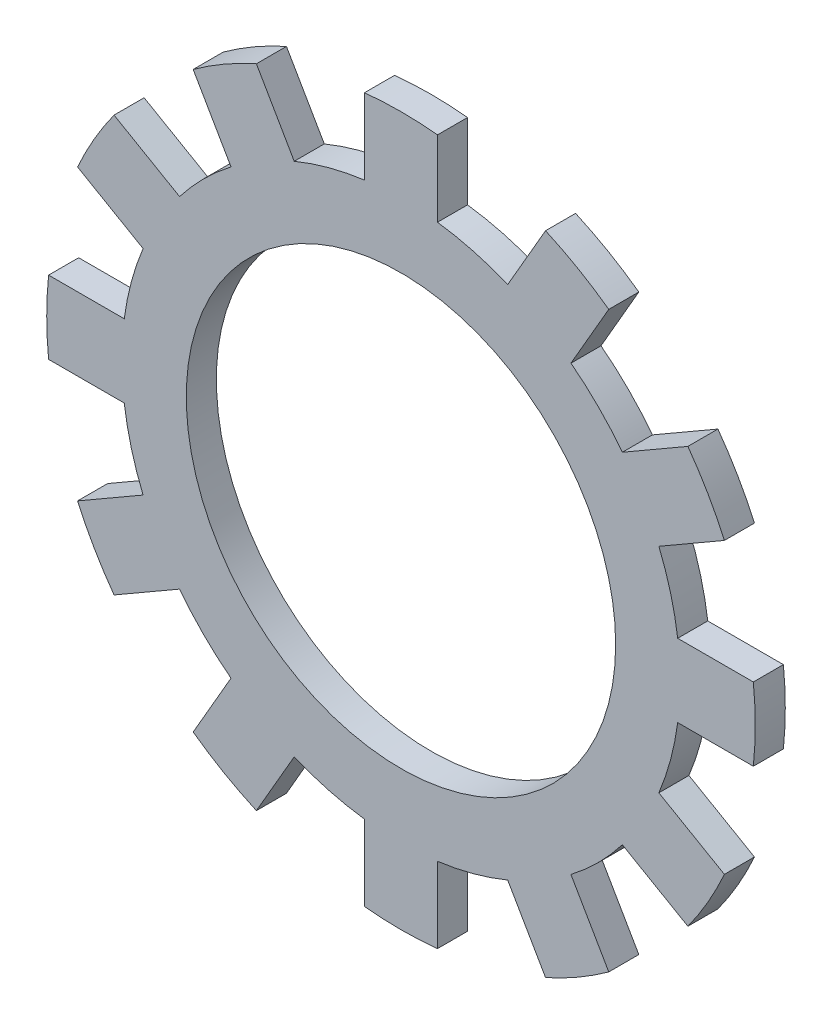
from build123d import *

# Parameters (mm, degrees)
SKETCH1_R                 = 13
SKETCH1_R_2               = 10
BOSS_EXTRUDE1_DEPTH       = 0.7
BOSS_EXTRUDE2_DEPTH       = 0.7
CIRPATTERN2_COUNT         = 12
CIRPATTERN2_COPY_1_DEPTH  = 0.7
CIRPATTERN2_COPY_2_DEPTH  = 0.7
CIRPATTERN2_COPY_3_DEPTH  = 0.7
CIRPATTERN2_COPY_4_DEPTH  = 0.7
CIRPATTERN2_COPY_5_DEPTH  = 0.7
CIRPATTERN2_COPY_6_DEPTH  = 0.7
CIRPATTERN2_COPY_7_DEPTH  = 0.7
CIRPATTERN2_COPY_8_DEPTH  = 0.7
CIRPATTERN2_COPY_9_DEPTH  = 0.7
CIRPATTERN2_COPY_10_DEPTH = 0.7
CIRPATTERN2_COPY_11_DEPTH = 0.7


with BuildPart() as part:
    # Sketch1 → Boss-Extrude1 (new, symmetric)
    with BuildSketch(Plane.XY):
        Circle(SKETCH1_R)
        Circle(SKETCH1_R_2, mode=Mode.SUBTRACT)
    extrude(amount=BOSS_EXTRUDE1_DEPTH, both=True)

    # Sketch3 → Boss-Extrude2 (add, symmetric)
    with BuildSketch(Plane.XY):
        with BuildLine():
            Line((-1.7, 16.412190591), (-1.7, 12.888366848))
            ThreePointArc((-1.7, 12.888366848), (-0.85183067, 12.972061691), (0, 13))
            Line((0, 13), (0, 16.5))
            ThreePointArc((0, 16.5), (-0.851133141, 16.478033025), (-1.7, 16.412190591))
        make_face()
    boss_extrude2 = extrude(amount=BOSS_EXTRUDE2_DEPTH, both=True)

    # Mirror1: Boss-Extrude2 across plane
    add(boss_extrude2.mirror(Plane(origin=(0, 0, 0), x_dir=(0, 0, 1), z_dir=(1, 0, 0))))

    # CirPattern2: Boss-Extrude2 ×12 about axis
    cirpattern2_axis = Axis((0, 0, 0), (0, 0, 1))
    for i in range(1, CIRPATTERN2_COUNT):
        add(boss_extrude2.rotate(cirpattern2_axis, i * 360 / CIRPATTERN2_COUNT))

    # CirPattern2 copy 1 sketch → CirPattern2 copy 1 (add, symmetric)
    with BuildSketch(Plane(origin=(0, 0, 0), x_dir=(-0.8660254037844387, -0.49999999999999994, 0), z_dir=(0, 0, 1))):
        with BuildLine():
            Line((-1.7, -16.412190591), (-1.7, -12.888366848))
            ThreePointArc((-1.7, -12.888366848), (-0.85183067, -12.972061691), (0, -13))
            Line((0, -13), (0, -16.5))
            ThreePointArc((0, -16.5), (-0.851133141, -16.478033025), (-1.7, -16.412190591))
        make_face()
    extrude(amount=CIRPATTERN2_COPY_1_DEPTH, both=True)

    # CirPattern2 copy 2 sketch → CirPattern2 copy 2 (add, symmetric)
    with BuildSketch(Plane(origin=(0, 0, 0), x_dir=(-0.5000000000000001, -0.8660254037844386, 0), z_dir=(0, 0, 1))):
        with BuildLine():
            Line((-1.7, -16.412190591), (-1.7, -12.888366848))
            ThreePointArc((-1.7, -12.888366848), (-0.85183067, -12.972061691), (0, -13))
            Line((0, -13), (0, -16.5))
            ThreePointArc((0, -16.5), (-0.851133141, -16.478033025), (-1.7, -16.412190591))
        make_face()
    extrude(amount=CIRPATTERN2_COPY_2_DEPTH, both=True)

    # CirPattern2 copy 3 sketch → CirPattern2 copy 3 (add, symmetric)
    with BuildSketch(Plane(origin=(0, 0, 0), x_dir=(0, -1, 0), z_dir=(0, 0, 1))):
        with BuildLine():
            Line((-1.7, -16.412190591), (-1.7, -12.888366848))
            ThreePointArc((-1.7, -12.888366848), (-0.85183067, -12.972061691), (0, -13))
            Line((0, -13), (0, -16.5))
            ThreePointArc((0, -16.5), (-0.851133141, -16.478033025), (-1.7, -16.412190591))
        make_face()
    extrude(amount=CIRPATTERN2_COPY_3_DEPTH, both=True)

    # CirPattern2 copy 4 sketch → CirPattern2 copy 4 (add, symmetric)
    with BuildSketch(Plane(origin=(0, 0, 0), x_dir=(0.4999999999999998, -0.8660254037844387, 0), z_dir=(0, 0, 1))):
        with BuildLine():
            Line((-1.7, -16.412190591), (-1.7, -12.888366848))
            ThreePointArc((-1.7, -12.888366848), (-0.85183067, -12.972061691), (0, -13))
            Line((0, -13), (0, -16.5))
            ThreePointArc((0, -16.5), (-0.851133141, -16.478033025), (-1.7, -16.412190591))
        make_face()
    extrude(amount=CIRPATTERN2_COPY_4_DEPTH, both=True)

    # CirPattern2 copy 5 sketch → CirPattern2 copy 5 (add, symmetric)
    with BuildSketch(Plane(origin=(0, 0, 0), x_dir=(0.8660254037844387, -0.49999999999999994, 0), z_dir=(0, 0, 1))):
        with BuildLine():
            Line((-1.7, -16.412190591), (-1.7, -12.888366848))
            ThreePointArc((-1.7, -12.888366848), (-0.85183067, -12.972061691), (0, -13))
            Line((0, -13), (0, -16.5))
            ThreePointArc((0, -16.5), (-0.851133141, -16.478033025), (-1.7, -16.412190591))
        make_face()
    extrude(amount=CIRPATTERN2_COPY_5_DEPTH, both=True)

    # CirPattern2 copy 6 sketch → CirPattern2 copy 6 (add, symmetric)
    with BuildSketch(Plane.XY):
        with BuildLine():
            Line((-1.7, -16.412190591), (-1.7, -12.888366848))
            ThreePointArc((-1.7, -12.888366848), (-0.85183067, -12.972061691), (0, -13))
            Line((0, -13), (0, -16.5))
            ThreePointArc((0, -16.5), (-0.851133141, -16.478033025), (-1.7, -16.412190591))
        make_face()
    extrude(amount=CIRPATTERN2_COPY_6_DEPTH, both=True)

    # CirPattern2 copy 7 sketch → CirPattern2 copy 7 (add, symmetric)
    with BuildSketch(Plane(origin=(0, 0, 0), x_dir=(0.8660254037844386, 0.5000000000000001, 0), z_dir=(0, 0, 1))):
        with BuildLine():
            Line((-1.7, -16.412190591), (-1.7, -12.888366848))
            ThreePointArc((-1.7, -12.888366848), (-0.85183067, -12.972061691), (0, -13))
            Line((0, -13), (0, -16.5))
            ThreePointArc((0, -16.5), (-0.851133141, -16.478033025), (-1.7, -16.412190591))
        make_face()
    extrude(amount=CIRPATTERN2_COPY_7_DEPTH, both=True)

    # CirPattern2 copy 8 sketch → CirPattern2 copy 8 (add, symmetric)
    with BuildSketch(Plane(origin=(0, 0, 0), x_dir=(0.5000000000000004, 0.8660254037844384, 0), z_dir=(0, 0, 1))):
        with BuildLine():
            Line((-1.7, -16.412190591), (-1.7, -12.888366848))
            ThreePointArc((-1.7, -12.888366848), (-0.85183067, -12.972061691), (0, -13))
            Line((0, -13), (0, -16.5))
            ThreePointArc((0, -16.5), (-0.851133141, -16.478033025), (-1.7, -16.412190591))
        make_face()
    extrude(amount=CIRPATTERN2_COPY_8_DEPTH, both=True)

    # CirPattern2 copy 9 sketch → CirPattern2 copy 9 (add, symmetric)
    with BuildSketch(Plane(origin=(0, 0, 0), x_dir=(0, 1, 0), z_dir=(0, 0, 1))):
        with BuildLine():
            Line((-1.7, -16.412190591), (-1.7, -12.888366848))
            ThreePointArc((-1.7, -12.888366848), (-0.85183067, -12.972061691), (0, -13))
            Line((0, -13), (0, -16.5))
            ThreePointArc((0, -16.5), (-0.851133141, -16.478033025), (-1.7, -16.412190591))
        make_face()
    extrude(amount=CIRPATTERN2_COPY_9_DEPTH, both=True)

    # CirPattern2 copy 10 sketch → CirPattern2 copy 10 (add, symmetric)
    with BuildSketch(Plane(origin=(0, 0, 0), x_dir=(-0.5000000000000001, 0.8660254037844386, 0), z_dir=(0, 0, 1))):
        with BuildLine():
            Line((-1.7, -16.412190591), (-1.7, -12.888366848))
            ThreePointArc((-1.7, -12.888366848), (-0.85183067, -12.972061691), (0, -13))
            Line((0, -13), (0, -16.5))
            ThreePointArc((0, -16.5), (-0.851133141, -16.478033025), (-1.7, -16.412190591))
        make_face()
    extrude(amount=CIRPATTERN2_COPY_10_DEPTH, both=True)

    # CirPattern2 copy 11 sketch → CirPattern2 copy 11 (add, symmetric)
    with BuildSketch(Plane(origin=(0, 0, 0), x_dir=(-0.8660254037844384, 0.5000000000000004, 0), z_dir=(0, 0, 1))):
        with BuildLine():
            Line((-1.7, -16.412190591), (-1.7, -12.888366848))
            ThreePointArc((-1.7, -12.888366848), (-0.85183067, -12.972061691), (0, -13))
            Line((0, -13), (0, -16.5))
            ThreePointArc((0, -16.5), (-0.851133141, -16.478033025), (-1.7, -16.412190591))
        make_face()
    extrude(amount=CIRPATTERN2_COPY_11_DEPTH, both=True)


solid = part.part
